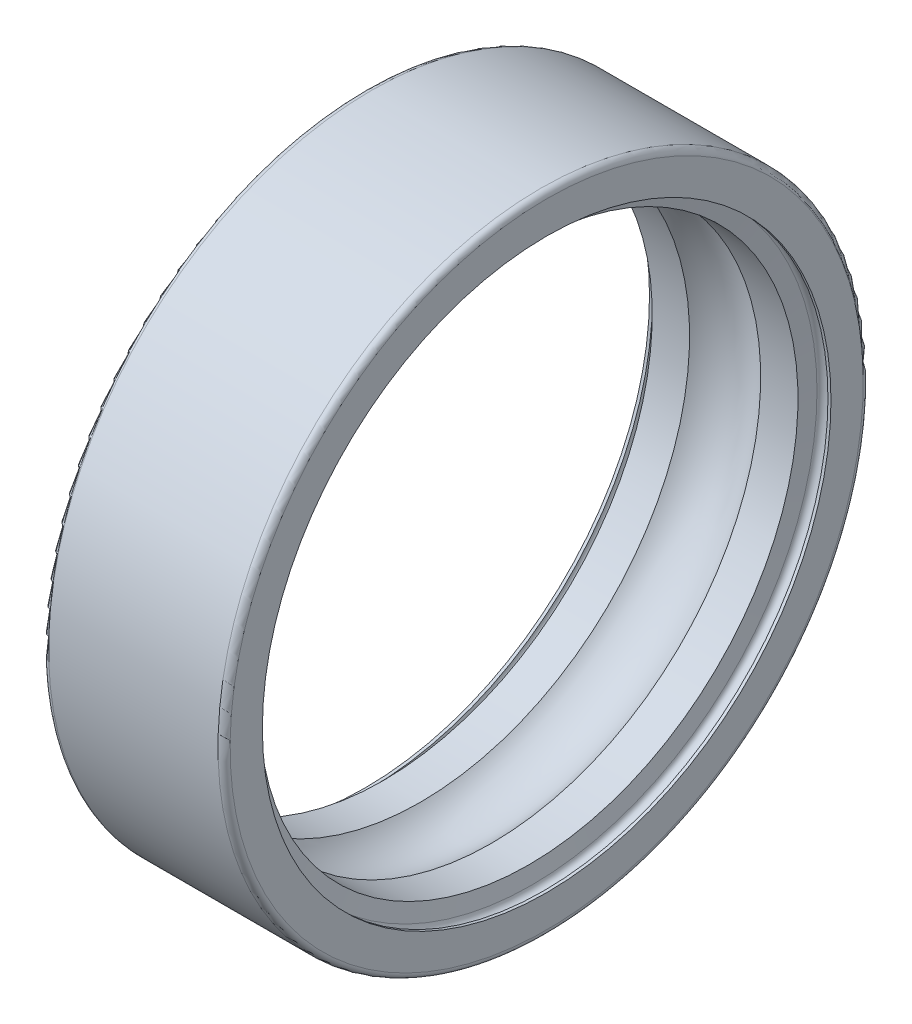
ISO-10303-21;
HEADER;
FILE_DESCRIPTION(('STEP AP214'),'2;1');
FILE_NAME('part.step','',(''),(''),'','','');
FILE_SCHEMA(('AUTOMOTIVE_DESIGN { 1 0 10303 214 1 1 1 1 }'));
ENDSEC;
DATA;
#1=APPLICATION_CONTEXT('core data for automotive mechanical design processes');
#2=APPLICATION_PROTOCOL_DEFINITION('international standard','automotive_design',2000,#1);
#3=PRODUCT_CONTEXT('',#1,'mechanical');
#4=PRODUCT('Part','Part','',(#3));
#5=PRODUCT_RELATED_PRODUCT_CATEGORY('part','',(#4));
#6=PRODUCT_DEFINITION_FORMATION('','',#4);
#7=PRODUCT_DEFINITION_CONTEXT('part definition',#1,'design');
#8=PRODUCT_DEFINITION('design','',#6,#7);
#9=PRODUCT_DEFINITION_SHAPE('','',#8);
#10=(LENGTH_UNIT() NAMED_UNIT(*) SI_UNIT(.MILLI.,.METRE.));
#11=(NAMED_UNIT(*) PLANE_ANGLE_UNIT() SI_UNIT($,.RADIAN.));
#12=(NAMED_UNIT(*) SI_UNIT($,.STERADIAN.) SOLID_ANGLE_UNIT());
#13=UNCERTAINTY_MEASURE_WITH_UNIT(LENGTH_MEASURE(1.E-05),#10,'distance_accuracy_value','');
#14=(GEOMETRIC_REPRESENTATION_CONTEXT(3) GLOBAL_UNCERTAINTY_ASSIGNED_CONTEXT((#13)) GLOBAL_UNIT_ASSIGNED_CONTEXT((#10,
#11,#12)) REPRESENTATION_CONTEXT('',''));
#15=CARTESIAN_POINT('',(0.,0.,0.));
#16=DIRECTION('',(0.,0.,1.));
#17=DIRECTION('',(1.,0.,0.));
#18=AXIS2_PLACEMENT_3D('',#15,#16,#17);
#19=CARTESIAN_POINT('',(8.55,0.,0.));
#20=DIRECTION('',(1.,0.,0.));
#21=DIRECTION('',(0.,0.,-1.));
#22=AXIS2_PLACEMENT_3D('',#19,#20,#21);
#23=TOROIDAL_SURFACE('',#22,14.1,0.3);
#24=CARTESIAN_POINT('',(8.85,0.,0.));
#25=DIRECTION('',(1.,0.,0.));
#26=DIRECTION('',(0.,1.,0.));
#27=AXIS2_PLACEMENT_3D('',#24,#25,#26);
#28=CIRCLE('',#27,14.1);
#29=CARTESIAN_POINT('',(8.85,14.1,0.));
#30=VERTEX_POINT('',#29);
#31=EDGE_CURVE('E10',#30,#30,#28,.T.);
#32=ORIENTED_EDGE('',*,*,#31,.T.);
#33=EDGE_LOOP('',(#32));
#34=FACE_BOUND('',#33,.T.);
#35=CARTESIAN_POINT('',(8.25455767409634,0.,0.));
#36=DIRECTION('',(1.,0.,0.));
#37=DIRECTION('',(0.,1.,0.));
#38=AXIS2_PLACEMENT_3D('',#35,#36,#37);
#39=CIRCLE('',#38,14.1520944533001);
#40=CARTESIAN_POINT('',(8.25455767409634,14.1520944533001,0.));
#41=VERTEX_POINT('',#40);
#42=EDGE_CURVE('E86',#41,#41,#39,.T.);
#43=ORIENTED_EDGE('',*,*,#42,.F.);
#44=EDGE_LOOP('',(#43));
#45=FACE_BOUND('',#44,.T.);
#46=ADVANCED_FACE('F15',(#34,#45),#23,.F.);
#47=CARTESIAN_POINT('',(8.925,0.,0.));
#48=DIRECTION('',(-1.,0.,0.));
#49=DIRECTION('',(0.,1.,0.));
#50=AXIS2_PLACEMENT_3D('',#47,#48,#49);
#51=CYLINDRICAL_SURFACE('',#50,14.1);
#52=CARTESIAN_POINT('',(9.,0.,0.));
#53=DIRECTION('',(1.,0.,0.));
#54=DIRECTION('',(0.,1.,0.));
#55=AXIS2_PLACEMENT_3D('',#52,#53,#54);
#56=CIRCLE('',#55,14.1);
#57=CARTESIAN_POINT('',(9.,14.1,0.));
#58=VERTEX_POINT('',#57);
#59=EDGE_CURVE('E25',#58,#58,#56,.T.);
#60=ORIENTED_EDGE('',*,*,#59,.T.);
#61=EDGE_LOOP('',(#60));
#62=FACE_BOUND('',#61,.T.);
#63=ORIENTED_EDGE('',*,*,#31,.F.);
#64=EDGE_LOOP('',(#63));
#65=FACE_BOUND('',#64,.T.);
#66=ADVANCED_FACE('F118',(#62,#65),#51,.F.);
#67=CARTESIAN_POINT('',(9.,14.9,0.));
#68=DIRECTION('',(1.,0.,0.));
#69=DIRECTION('',(0.,1.,0.));
#70=AXIS2_PLACEMENT_3D('',#67,#68,#69);
#71=PLANE('',#70);
#72=CARTESIAN_POINT('',(9.,0.,0.));
#73=DIRECTION('',(1.,0.,0.));
#74=DIRECTION('',(0.,1.,0.));
#75=AXIS2_PLACEMENT_3D('',#72,#73,#74);
#76=CIRCLE('',#75,15.7);
#77=CARTESIAN_POINT('',(9.,15.7,0.));
#78=VERTEX_POINT('',#77);
#79=EDGE_CURVE('E82',#78,#78,#76,.T.);
#80=ORIENTED_EDGE('',*,*,#79,.T.);
#81=EDGE_LOOP('',(#80));
#82=FACE_BOUND('',#81,.T.);
#83=ORIENTED_EDGE('',*,*,#59,.F.);
#84=EDGE_LOOP('',(#83));
#85=FACE_BOUND('',#84,.T.);
#86=ADVANCED_FACE('F114',(#82,#85),#71,.T.);
#87=CARTESIAN_POINT('',(8.7,0.,0.));
#88=DIRECTION('',(1.,0.,0.));
#89=DIRECTION('',(0.,0.,-1.));
#90=AXIS2_PLACEMENT_3D('',#87,#88,#89);
#91=TOROIDAL_SURFACE('',#90,15.7,0.3);
#92=CARTESIAN_POINT('',(8.7,0.,0.));
#93=DIRECTION('',(1.,0.,0.));
#94=DIRECTION('',(0.,1.,0.));
#95=AXIS2_PLACEMENT_3D('',#92,#93,#94);
#96=CIRCLE('',#95,16.);
#97=CARTESIAN_POINT('',(8.7,16.,0.));
#98=VERTEX_POINT('',#97);
#99=EDGE_CURVE('E80',#98,#98,#96,.T.);
#100=ORIENTED_EDGE('',*,*,#99,.T.);
#101=EDGE_LOOP('',(#100));
#102=FACE_BOUND('',#101,.T.);
#103=ORIENTED_EDGE('',*,*,#79,.F.);
#104=EDGE_LOOP('',(#103));
#105=FACE_BOUND('',#104,.T.);
#106=ADVANCED_FACE('F99',(#102,#105),#91,.T.);
#107=CARTESIAN_POINT('',(4.5,0.,0.));
#108=DIRECTION('',(-1.,0.,0.));
#109=DIRECTION('',(0.,1.,0.));
#110=AXIS2_PLACEMENT_3D('',#107,#108,#109);
#111=CYLINDRICAL_SURFACE('',#110,16.);
#112=CARTESIAN_POINT('',(0.3,0.,0.));
#113=DIRECTION('',(1.,0.,0.));
#114=DIRECTION('',(0.,1.,0.));
#115=AXIS2_PLACEMENT_3D('',#112,#113,#114);
#116=CIRCLE('',#115,16.);
#117=CARTESIAN_POINT('',(0.3,16.,0.));
#118=VERTEX_POINT('',#117);
#119=EDGE_CURVE('E77',#118,#118,#116,.T.);
#120=ORIENTED_EDGE('',*,*,#119,.T.);
#121=EDGE_LOOP('',(#120));
#122=FACE_BOUND('',#121,.T.);
#123=ORIENTED_EDGE('',*,*,#99,.F.);
#124=EDGE_LOOP('',(#123));
#125=FACE_BOUND('',#124,.T.);
#126=ADVANCED_FACE('F102',(#122,#125),#111,.T.);
#127=CARTESIAN_POINT('',(0.3,0.,0.));
#128=DIRECTION('',(1.,0.,0.));
#129=DIRECTION('',(0.,0.,-1.));
#130=AXIS2_PLACEMENT_3D('',#127,#128,#129);
#131=TOROIDAL_SURFACE('',#130,15.7,0.3);
#132=CARTESIAN_POINT('',(0.,0.,0.));
#133=DIRECTION('',(1.,0.,0.));
#134=DIRECTION('',(0.,1.,0.));
#135=AXIS2_PLACEMENT_3D('',#132,#133,#134);
#136=CIRCLE('',#135,15.7);
#137=CARTESIAN_POINT('',(0.,15.7,0.));
#138=VERTEX_POINT('',#137);
#139=EDGE_CURVE('E81',#138,#138,#136,.T.);
#140=ORIENTED_EDGE('',*,*,#139,.T.);
#141=EDGE_LOOP('',(#140));
#142=FACE_BOUND('',#141,.T.);
#143=ORIENTED_EDGE('',*,*,#119,.F.);
#144=EDGE_LOOP('',(#143));
#145=FACE_BOUND('',#144,.T.);
#146=ADVANCED_FACE('F104',(#142,#145),#131,.T.);
#147=CARTESIAN_POINT('',(0.,14.9,0.));
#148=DIRECTION('',(-1.,0.,0.));
#149=DIRECTION('',(0.,-1.,0.));
#150=AXIS2_PLACEMENT_3D('',#147,#148,#149);
#151=PLANE('',#150);
#152=CARTESIAN_POINT('',(0.,0.,0.));
#153=DIRECTION('',(1.,0.,0.));
#154=DIRECTION('',(0.,1.,0.));
#155=AXIS2_PLACEMENT_3D('',#152,#153,#154);
#156=CIRCLE('',#155,14.1);
#157=CARTESIAN_POINT('',(0.,14.1,0.));
#158=VERTEX_POINT('',#157);
#159=EDGE_CURVE('E72',#158,#158,#156,.T.);
#160=ORIENTED_EDGE('',*,*,#159,.T.);
#161=EDGE_LOOP('',(#160));
#162=FACE_BOUND('',#161,.T.);
#163=ORIENTED_EDGE('',*,*,#139,.F.);
#164=EDGE_LOOP('',(#163));
#165=FACE_BOUND('',#164,.T.);
#166=ADVANCED_FACE('F111',(#162,#165),#151,.T.);
#167=CARTESIAN_POINT('',(0.075,0.,0.));
#168=DIRECTION('',(-1.,0.,0.));
#169=DIRECTION('',(0.,1.,0.));
#170=AXIS2_PLACEMENT_3D('',#167,#168,#169);
#171=CYLINDRICAL_SURFACE('',#170,14.1);
#172=CARTESIAN_POINT('',(0.15,0.,0.));
#173=DIRECTION('',(1.,0.,0.));
#174=DIRECTION('',(0.,1.,0.));
#175=AXIS2_PLACEMENT_3D('',#172,#173,#174);
#176=CIRCLE('',#175,14.1);
#177=CARTESIAN_POINT('',(0.15,14.1,0.));
#178=VERTEX_POINT('',#177);
#179=EDGE_CURVE('E19',#178,#178,#176,.T.);
#180=ORIENTED_EDGE('',*,*,#179,.T.);
#181=EDGE_LOOP('',(#180));
#182=FACE_BOUND('',#181,.T.);
#183=ORIENTED_EDGE('',*,*,#159,.F.);
#184=EDGE_LOOP('',(#183));
#185=FACE_BOUND('',#184,.T.);
#186=ADVANCED_FACE('F128',(#182,#185),#171,.F.);
#187=CARTESIAN_POINT('',(0.45,0.,0.));
#188=DIRECTION('',(1.,0.,0.));
#189=DIRECTION('',(0.,0.,-1.));
#190=AXIS2_PLACEMENT_3D('',#187,#188,#189);
#191=TOROIDAL_SURFACE('',#190,14.1,0.3);
#192=CARTESIAN_POINT('',(0.745442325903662,0.,0.));
#193=DIRECTION('',(1.,0.,0.));
#194=DIRECTION('',(0.,1.,0.));
#195=AXIS2_PLACEMENT_3D('',#192,#193,#194);
#196=CIRCLE('',#195,14.1520944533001);
#197=CARTESIAN_POINT('',(0.745442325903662,14.1520944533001,0.));
#198=VERTEX_POINT('',#197);
#199=EDGE_CURVE('E66',#198,#198,#196,.T.);
#200=ORIENTED_EDGE('',*,*,#199,.T.);
#201=EDGE_LOOP('',(#200));
#202=FACE_BOUND('',#201,.T.);
#203=ORIENTED_EDGE('',*,*,#179,.F.);
#204=EDGE_LOOP('',(#203));
#205=FACE_BOUND('',#204,.T.);
#206=ADVANCED_FACE('F67',(#202,#205),#191,.F.);
#207=CARTESIAN_POINT('',(0.816157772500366,0.,0.));
#208=DIRECTION('',(-1.,0.,0.));
#209=DIRECTION('',(0.,1.,0.));
#210=AXIS2_PLACEMENT_3D('',#207,#208,#209);
#211=CONICAL_SURFACE('',#210,13.75104722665,1.39626340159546);
#212=CARTESIAN_POINT('',(0.886873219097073,0.,0.));
#213=DIRECTION('',(1.,0.,0.));
#214=DIRECTION('',(0.,1.,0.));
#215=AXIS2_PLACEMENT_3D('',#212,#213,#214);
#216=CIRCLE('',#215,13.35);
#217=CARTESIAN_POINT('',(0.886873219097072,13.35,0.));
#218=VERTEX_POINT('',#217);
#219=EDGE_CURVE('E70',#218,#218,#216,.T.);
#220=ORIENTED_EDGE('',*,*,#219,.T.);
#221=EDGE_LOOP('',(#220));
#222=FACE_BOUND('',#221,.T.);
#223=ORIENTED_EDGE('',*,*,#199,.F.);
#224=EDGE_LOOP('',(#223));
#225=FACE_BOUND('',#224,.T.);
#226=ADVANCED_FACE('F132',(#222,#225),#211,.F.);
#227=CARTESIAN_POINT('',(1.81179595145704,0.,0.));
#228=DIRECTION('',(-1.,0.,0.));
#229=DIRECTION('',(0.,1.,0.));
#230=AXIS2_PLACEMENT_3D('',#227,#228,#229);
#231=CYLINDRICAL_SURFACE('',#230,13.35);
#232=CARTESIAN_POINT('',(2.73671868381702,0.,0.));
#233=DIRECTION('',(1.,0.,0.));
#234=DIRECTION('',(0.,1.,0.));
#235=AXIS2_PLACEMENT_3D('',#232,#233,#234);
#236=CIRCLE('',#235,13.35);
#237=CARTESIAN_POINT('',(2.73671868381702,13.35,0.));
#238=VERTEX_POINT('',#237);
#239=EDGE_CURVE('E73',#238,#238,#236,.T.);
#240=ORIENTED_EDGE('',*,*,#239,.T.);
#241=EDGE_LOOP('',(#240));
#242=FACE_BOUND('',#241,.T.);
#243=ORIENTED_EDGE('',*,*,#219,.F.);
#244=EDGE_LOOP('',(#243));
#245=FACE_BOUND('',#244,.T.);
#246=ADVANCED_FACE('F135',(#242,#245),#231,.F.);
#247=CARTESIAN_POINT('',(4.5,0.,0.));
#248=DIRECTION('',(1.,0.,0.));
#249=DIRECTION('',(0.,0.,-1.));
#250=AXIS2_PLACEMENT_3D('',#247,#248,#249);
#251=TOROIDAL_SURFACE('',#250,11.75,2.381);
#252=CARTESIAN_POINT('',(6.26328131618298,0.,0.));
#253=DIRECTION('',(1.,0.,0.));
#254=DIRECTION('',(0.,1.,0.));
#255=AXIS2_PLACEMENT_3D('',#252,#253,#254);
#256=CIRCLE('',#255,13.35);
#257=CARTESIAN_POINT('',(6.26328131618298,13.35,0.));
#258=VERTEX_POINT('',#257);
#259=EDGE_CURVE('E87',#258,#258,#256,.T.);
#260=ORIENTED_EDGE('',*,*,#259,.T.);
#261=EDGE_LOOP('',(#260));
#262=FACE_BOUND('',#261,.T.);
#263=ORIENTED_EDGE('',*,*,#239,.F.);
#264=EDGE_LOOP('',(#263));
#265=FACE_BOUND('',#264,.T.);
#266=ADVANCED_FACE('F140',(#262,#265),#251,.F.);
#267=CARTESIAN_POINT('',(7.18820404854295,0.,0.));
#268=DIRECTION('',(-1.,0.,0.));
#269=DIRECTION('',(0.,1.,0.));
#270=AXIS2_PLACEMENT_3D('',#267,#268,#269);
#271=CYLINDRICAL_SURFACE('',#270,13.35);
#272=CARTESIAN_POINT('',(8.11312678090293,0.,0.));
#273=DIRECTION('',(1.,0.,0.));
#274=DIRECTION('',(0.,1.,0.));
#275=AXIS2_PLACEMENT_3D('',#272,#273,#274);
#276=CIRCLE('',#275,13.35);
#277=CARTESIAN_POINT('',(8.11312678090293,13.35,0.));
#278=VERTEX_POINT('',#277);
#279=EDGE_CURVE('E84',#278,#278,#276,.T.);
#280=ORIENTED_EDGE('',*,*,#279,.T.);
#281=EDGE_LOOP('',(#280));
#282=FACE_BOUND('',#281,.T.);
#283=ORIENTED_EDGE('',*,*,#259,.F.);
#284=EDGE_LOOP('',(#283));
#285=FACE_BOUND('',#284,.T.);
#286=ADVANCED_FACE('F17',(#282,#285),#271,.F.);
#287=CARTESIAN_POINT('',(8.18384222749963,0.,0.));
#288=DIRECTION('',(1.,0.,0.));
#289=DIRECTION('',(0.,1.,0.));
#290=AXIS2_PLACEMENT_3D('',#287,#288,#289);
#291=CONICAL_SURFACE('',#290,13.75104722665,1.39626340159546);
#292=ORIENTED_EDGE('',*,*,#42,.T.);
#293=EDGE_LOOP('',(#292));
#294=FACE_BOUND('',#293,.T.);
#295=ORIENTED_EDGE('',*,*,#279,.F.);
#296=EDGE_LOOP('',(#295));
#297=FACE_BOUND('',#296,.T.);
#298=ADVANCED_FACE('F137',(#294,#297),#291,.F.);
#299=CLOSED_SHELL('',(#46,#66,#86,#106,#126,#146,#166,#186,#206,#226,#246,#266,#286,#298));
#300=MANIFOLD_SOLID_BREP('B1',#299);
#301=ADVANCED_BREP_SHAPE_REPRESENTATION('',(#18,#300),#14);
#302=SHAPE_DEFINITION_REPRESENTATION(#9,#301);
ENDSEC;
END-ISO-10303-21;
